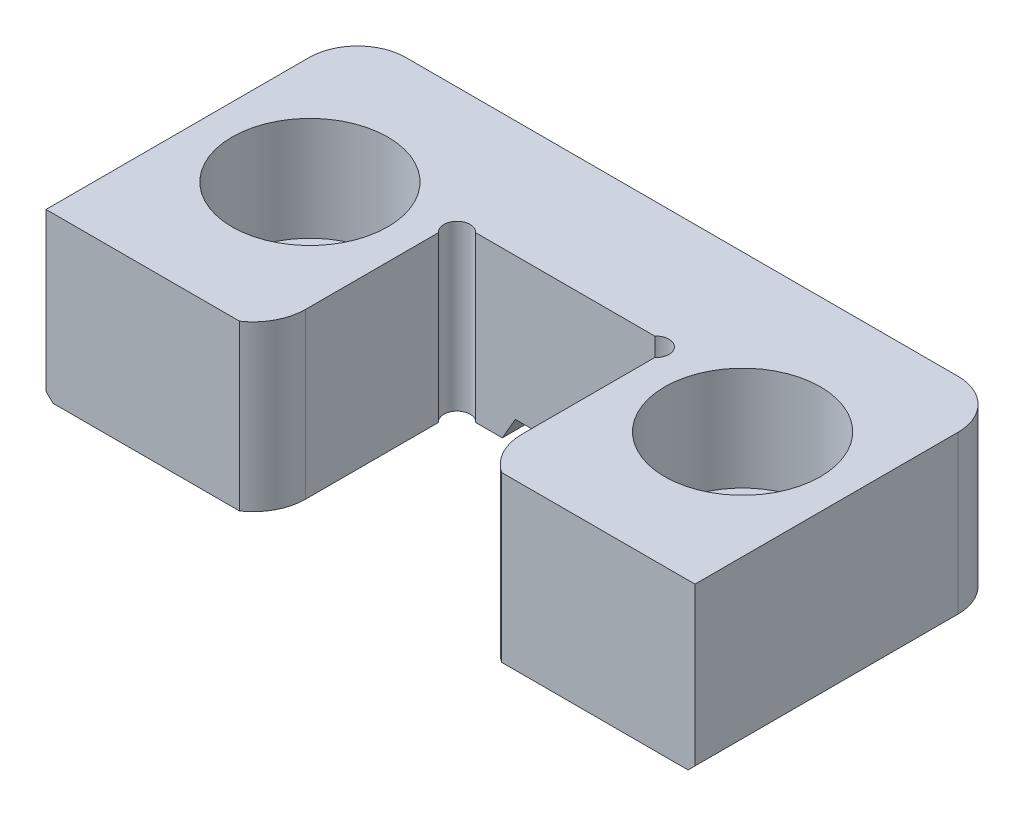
from build123d import *

# Parameters (mm, degrees)
BOSS_EXTRUDE1_DEPTH             = 19
FILLET1_R                       = 5.6
CUT_EXTRUDE1_DEPTH              = 56.346634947
SKETCH3_R                       = 1.52
CUT_EXTRUDE2_DEPTH              = 56.346634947
CUT_EXTRUDE3_DEPTH              = 56.346634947
CHAMFER5_SIZE                   = 3.8
CHAMFER5_SIZE2                  = 1.018206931
CBORE_FOR_M10_SHCS1_D           = 11
CBORE_FOR_M10_SHCS1_CBORE_D     = 18
CBORE_FOR_M10_SHCS1_CBORE_DEPTH = 12
CHAMFER6_SIZE                   = 0.8


with BuildPart() as part:
    # Sketch1 → Boss-Extrude1 (new body)
    with BuildSketch(Plane(origin=(0, 0, 0), x_dir=(1, 0, 0), z_dir=(0, 1, 0))):
        Polygon((12.499, 0), (37.5, 0), (37.5, 36), (-37.5, 36), (-37.5, 0), (-12.499, 0), (-12.499, 22.5), (12.499, 22.5), align=None)
    extrude(amount=-BOSS_EXTRUDE1_DEPTH)

    # Fillet1
    fillet1_edges = [part.edges().sort_by_distance(p)[0] for p in [
        (-37.5, -9.5, -36),
        (37.5, -9.5, -36),
    ]]
    fillet(fillet1_edges, radius=FILLET1_R)

    # Sketch2 → Cut-Extrude1 (cut, through all)
    with BuildSketch(Plane(origin=(0, 0, 0), x_dir=(1, 0, 0), z_dir=(0, 1, 0))):
        with BuildLine():
            Line((-12.499, 5), (-12.499, 12.7))
            Line((-12.499, 12.7), (12.499, 12.7))
            Line((12.499, 12.7), (12.499, 5))
            ThreePointArc((12.499, 5), (13.199896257, 2.172619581), (15.140272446, 0))
            Line((15.140272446, 0), (25.199, 0))
            Line((25.199, 0), (25.199, -25.4))
            Line((25.199, -25.4), (-25.199, -25.4))
            Line((-25.199, -25.4), (-25.199, 0))
            Line((-25.199, 0), (-15.140272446, 0))
            ThreePointArc((-15.140272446, 0), (-13.199896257, 2.172619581), (-12.499, 5))
        make_face()
    extrude(amount=-CUT_EXTRUDE1_DEPTH, mode=Mode.SUBTRACT)

    # Sketch3 → Cut-Extrude2 (cut, through all)
    with BuildSketch(Plane(origin=(0, 0, 0), x_dir=(1, 0, 0), z_dir=(0, 1, 0))):
        with Locations((-11.489, 21.49)):
            Circle(SKETCH3_R)
        with Locations((11.489, 21.49)):
            Circle(SKETCH3_R)
    extrude(amount=-CUT_EXTRUDE2_DEPTH, mode=Mode.SUBTRACT)

    # Sketch5 → Cut-Extrude3 (cut, through all)
    with BuildSketch(Plane(origin=(0, 0, -36), x_dir=(-1, 0, 0), z_dir=(0, 0, -1))):
        Polygon((-6.35, -17.41), (6.35, -17.41), (7.267986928, -19), (-7.267986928, -19), align=None)
    extrude(amount=-CUT_EXTRUDE3_DEPTH, mode=Mode.SUBTRACT)

    # Chamfer5
    chamfer5_edges = [part.edges().sort_by_distance(p)[0] for p in [
        (0, -17.41, -22.5),
    ]]
    chamfer5_side = [part.faces().sort_by_distance(p)[0] for p in [
        (0, -17.41, -29.25),
    ]]
    chamfer(chamfer5_edges, length=CHAMFER5_SIZE, length2=CHAMFER5_SIZE2, reference=chamfer5_side[0])

    # CBORE for M10 SHCS1 (through all)
    with Locations(Plane(origin=(0, 0, 0), x_dir=(-1, 0, 0), z_dir=(0, 1, 0))):
        with Locations((-25, -18), (25, -18)):
            CounterBoreHole(CBORE_FOR_M10_SHCS1_D / 2, CBORE_FOR_M10_SHCS1_CBORE_D / 2, CBORE_FOR_M10_SHCS1_CBORE_DEPTH)

    # Chamfer6
    chamfer6_edges = [part.edges().sort_by_distance(p)[0] for p in [
        (37.5, -19, -15.2),
        (19.583993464, -19, -36),
        (-37.5, -19, -15.2),
        (-35.859797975, -19, -34.359797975),
        (35.859797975, -19, -34.359797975),
        (-19.583993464, -19, -36),
    ]]
    chamfer(chamfer6_edges, length=CHAMFER6_SIZE)


solid = part.part
